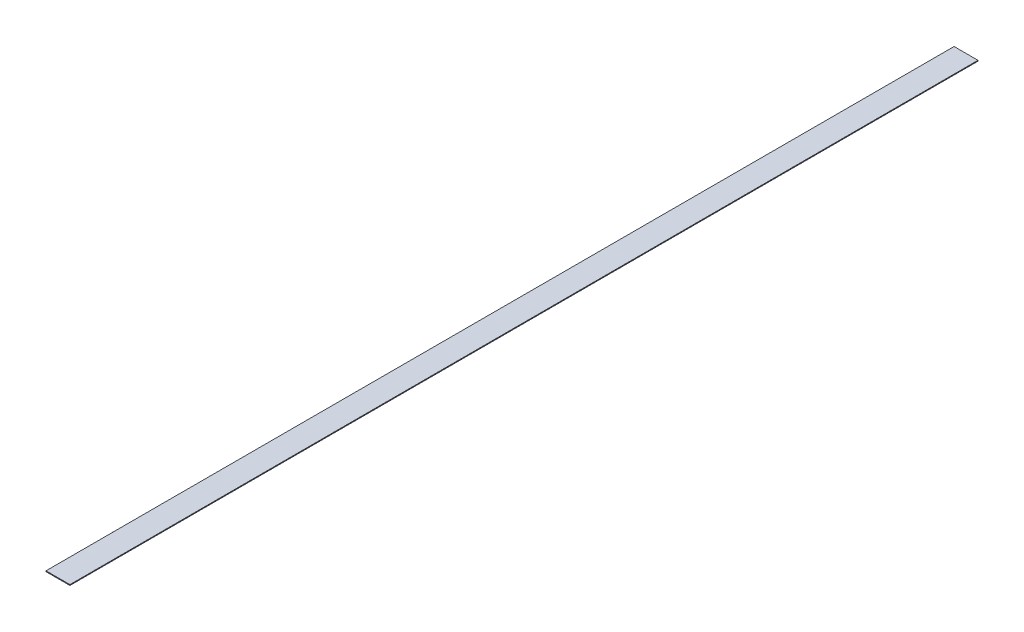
from build123d import *

# Parameters (mm, degrees)
ESQUISSE1_W      = 15
ESQUISSE1_H      = 570
EXTRUSION1_DEPTH = 0.5


with BuildPart() as part:
    # Esquisse1 → Extrusion1 (new body)
    with BuildSketch(Plane(origin=(0, 0, 0), x_dir=(1, 0, 0), z_dir=(0, 1, 0))):
        with Locations((7.5, 285)):
            Rectangle(ESQUISSE1_W, ESQUISSE1_H)
    extrude(amount=EXTRUSION1_DEPTH)


solid = part.part
